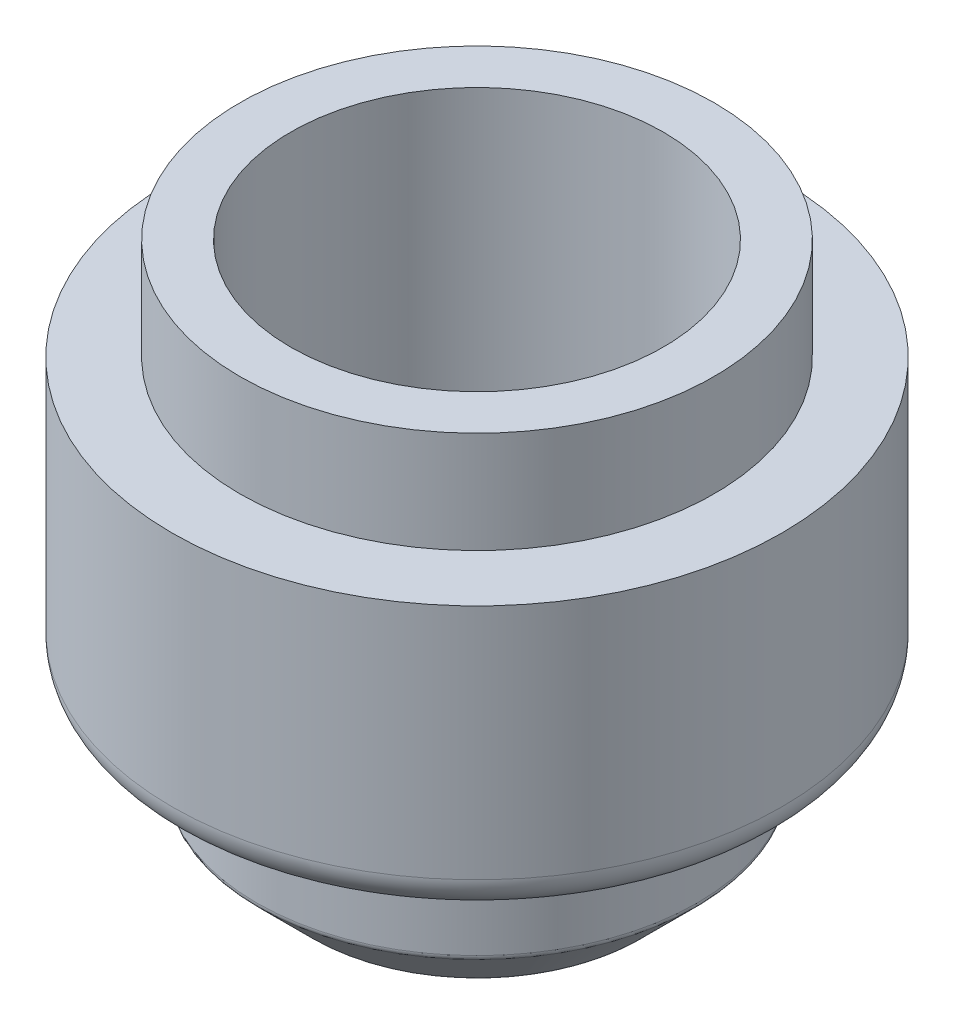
from build123d import *

# Parameters (mm, degrees)
CONG_1_R = 1


with BuildPart() as part:
    # Esquisse1 → R_volution1 (revolve)
    with BuildSketch(Plane.XY, mode=Mode.PRIVATE) as r_volution1_sk:
        with BuildLine():
            Line((-5.110971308, 32.451042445), (-5.110971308, 24.451042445))
            Line((-5.110971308, 24.451042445), (-3.610971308, 24.451042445))
            Line((-3.610971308, 24.451042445), (-3.610971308, 27.243935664))
            ThreePointArc((-3.610971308, 27.243935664), (-3.649031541, 27.43527738), (-3.757417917, 27.597489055))
            Line((-3.757417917, 27.597489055), (-3.863484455, 27.703555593))
            ThreePointArc((-3.863484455, 27.703555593), (-3.863484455, 28.410662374), (-3.156377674, 28.410662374))
            Line((-3.156377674, 28.410662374), (-2.757417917, 28.011702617))
            ThreePointArc((-2.757417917, 28.011702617), (-2.649031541, 27.849490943), (-2.610971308, 27.658149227))
            Line((-2.610971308, 27.658149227), (-2.610971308, 21.743935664))
            ThreePointArc((-2.610971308, 21.743935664), (-2.595747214, 21.667398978), (-2.552392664, 21.602514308))
            Line((-2.552392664, 21.602514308), (-0.952392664, 20.002514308))
            ThreePointArc((-0.952392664, 20.002514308), (-0.734434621, 19.959159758), (-0.610971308, 20.143935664))
            Line((-0.610971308, 20.143935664), (-0.610971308, 20.28535702))
            ThreePointArc((-0.610971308, 20.28535702), (-0.626195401, 20.361893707), (-0.669549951, 20.426778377))
            Line((-0.669549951, 20.426778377), (-2.052392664, 21.809621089))
            ThreePointArc((-2.052392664, 21.809621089), (-2.095747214, 21.874505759), (-2.110971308, 21.951042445))
            Line((-2.110971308, 21.951042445), (-2.110971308, 25.951042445))
            Line((-2.110971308, 25.951042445), (0.389028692, 25.951042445))
            Line((0.389028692, 25.951042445), (0.389028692, 27.451042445))
            Line((0.389028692, 27.451042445), (-1.610971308, 27.451042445))
            Line((-1.610971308, 27.451042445), (-1.610971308, 35.451042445))
            Line((-1.610971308, 35.451042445), (-3.110971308, 35.451042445))
            Line((-3.110971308, 35.451042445), (-3.110971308, 32.451042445))
            Line((-3.110971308, 32.451042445), (-5.110971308, 32.451042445))
        make_face()
    revolve(r_volution1_sk.sketch.rotate(Axis((3.889028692, 35.451042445, 0), (0, -1, 0)), 270), axis=Axis((3.889028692, 35.451042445, 0), (0, -1, 0)))

    # Cong_1
    cong_1_edges = [part.edges().sort_by_distance(p)[0] for p in [
        (3.889028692, 24.451042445, -9),
    ]]
    fillet(cong_1_edges, radius=CONG_1_R)


solid = part.part
